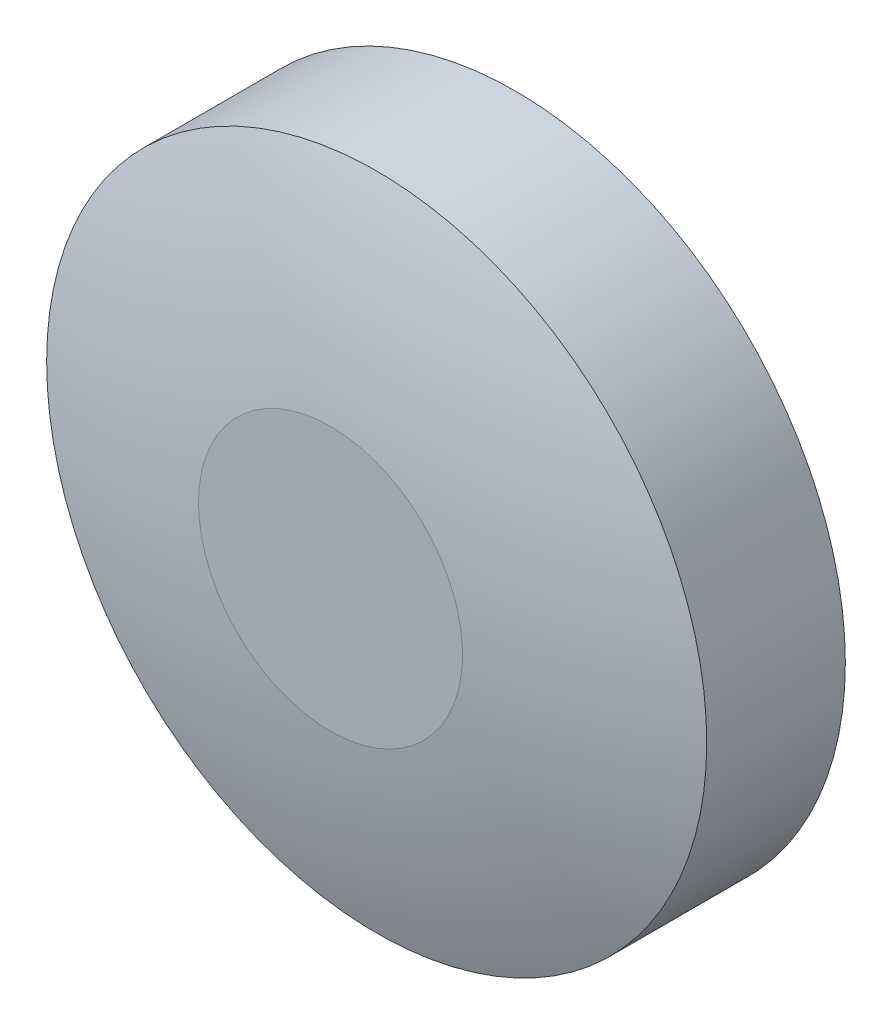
ISO-10303-21;
HEADER;
FILE_DESCRIPTION(('STEP AP214'),'2;1');
FILE_NAME('part.step','',(''),(''),'','','');
FILE_SCHEMA(('AUTOMOTIVE_DESIGN { 1 0 10303 214 1 1 1 1 }'));
ENDSEC;
DATA;
#1=APPLICATION_CONTEXT('core data for automotive mechanical design processes');
#2=APPLICATION_PROTOCOL_DEFINITION('international standard','automotive_design',2000,#1);
#3=PRODUCT_CONTEXT('',#1,'mechanical');
#4=PRODUCT('Part','Part','',(#3));
#5=PRODUCT_RELATED_PRODUCT_CATEGORY('part','',(#4));
#6=PRODUCT_DEFINITION_FORMATION('','',#4);
#7=PRODUCT_DEFINITION_CONTEXT('part definition',#1,'design');
#8=PRODUCT_DEFINITION('design','',#6,#7);
#9=PRODUCT_DEFINITION_SHAPE('','',#8);
#10=(LENGTH_UNIT() NAMED_UNIT(*) SI_UNIT(.MILLI.,.METRE.));
#11=(NAMED_UNIT(*) PLANE_ANGLE_UNIT() SI_UNIT($,.RADIAN.));
#12=(NAMED_UNIT(*) SI_UNIT($,.STERADIAN.) SOLID_ANGLE_UNIT());
#13=UNCERTAINTY_MEASURE_WITH_UNIT(LENGTH_MEASURE(1.E-05),#10,'distance_accuracy_value','');
#14=(GEOMETRIC_REPRESENTATION_CONTEXT(3) GLOBAL_UNCERTAINTY_ASSIGNED_CONTEXT((#13)) GLOBAL_UNIT_ASSIGNED_CONTEXT((#10,
#11,#12)) REPRESENTATION_CONTEXT('',''));
#15=CARTESIAN_POINT('',(0.,0.,0.));
#16=DIRECTION('',(0.,0.,1.));
#17=DIRECTION('',(1.,0.,0.));
#18=AXIS2_PLACEMENT_3D('',#15,#16,#17);
#19=CARTESIAN_POINT('',(0.,2.44243974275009,6.));
#20=DIRECTION('',(0.,0.,-1.));
#21=DIRECTION('',(-1.,0.,0.));
#22=AXIS2_PLACEMENT_3D('',#19,#20,#21);
#23=PLANE('',#22);
#24=CARTESIAN_POINT('',(0.,0.,6.));
#25=DIRECTION('',(0.,0.,-1.));
#26=DIRECTION('',(-1.,0.,0.));
#27=AXIS2_PLACEMENT_3D('',#24,#25,#26);
#28=CIRCLE('',#27,4.88487948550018);
#29=CARTESIAN_POINT('',(-4.88487948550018,0.,6.));
#30=VERTEX_POINT('',#29);
#31=EDGE_CURVE('E15',#30,#30,#28,.T.);
#32=ORIENTED_EDGE('',*,*,#31,.T.);
#33=EDGE_LOOP('',(#32));
#34=FACE_BOUND('',#33,.T.);
#35=ADVANCED_FACE('F12',(#34),#23,.T.);
#36=CARTESIAN_POINT('',(0.,0.,4.45647187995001));
#37=DIRECTION('',(0.,0.,-1.));
#38=DIRECTION('',(-1.,0.,0.));
#39=AXIS2_PLACEMENT_3D('',#36,#37,#38);
#40=CONICAL_SURFACE('',#39,11.5,1.3415643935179);
#41=ORIENTED_EDGE('',*,*,#31,.F.);
#42=EDGE_LOOP('',(#41));
#43=FACE_BOUND('',#42,.T.);
#44=CARTESIAN_POINT('',(0.,0.,4.45647187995));
#45=DIRECTION('',(0.,0.,1.));
#46=DIRECTION('',(1.,0.,0.));
#47=AXIS2_PLACEMENT_3D('',#44,#45,#46);
#48=CIRCLE('',#47,11.5);
#49=CARTESIAN_POINT('',(11.5,0.,4.45647187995));
#50=VERTEX_POINT('',#49);
#51=EDGE_CURVE('E28',#50,#50,#48,.F.);
#52=ORIENTED_EDGE('',*,*,#51,.T.);
#53=EDGE_LOOP('',(#52));
#54=FACE_BOUND('',#53,.T.);
#55=ADVANCED_FACE('F41',(#43,#54),#40,.F.);
#56=CARTESIAN_POINT('',(0.,0.,2.228235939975));
#57=DIRECTION('',(0.,0.,1.));
#58=DIRECTION('',(1.,0.,0.));
#59=AXIS2_PLACEMENT_3D('',#56,#57,#58);
#60=CYLINDRICAL_SURFACE('',#59,11.5);
#61=ORIENTED_EDGE('',*,*,#51,.F.);
#62=EDGE_LOOP('',(#61));
#63=FACE_BOUND('',#62,.T.);
#64=CARTESIAN_POINT('',(0.,0.,0.));
#65=DIRECTION('',(0.,0.,1.));
#66=DIRECTION('',(1.,0.,0.));
#67=AXIS2_PLACEMENT_3D('',#64,#65,#66);
#68=CIRCLE('',#67,11.5);
#69=CARTESIAN_POINT('',(11.5,0.,0.));
#70=VERTEX_POINT('',#69);
#71=EDGE_CURVE('E30',#70,#70,#68,.T.);
#72=ORIENTED_EDGE('',*,*,#71,.F.);
#73=EDGE_LOOP('',(#72));
#74=FACE_BOUND('',#73,.T.);
#75=ADVANCED_FACE('F43',(#63,#74),#60,.F.);
#76=CARTESIAN_POINT('',(0.,12.,0.));
#77=DIRECTION('',(0.,0.,-1.));
#78=DIRECTION('',(-1.,0.,0.));
#79=AXIS2_PLACEMENT_3D('',#76,#77,#78);
#80=PLANE('',#79);
#81=CARTESIAN_POINT('',(0.,0.,0.));
#82=DIRECTION('',(0.,0.,1.));
#83=DIRECTION('',(1.,0.,0.));
#84=AXIS2_PLACEMENT_3D('',#81,#82,#83);
#85=CIRCLE('',#84,12.5);
#86=CARTESIAN_POINT('',(12.5,0.,0.));
#87=VERTEX_POINT('',#86);
#88=EDGE_CURVE('E24',#87,#87,#85,.T.);
#89=ORIENTED_EDGE('',*,*,#88,.F.);
#90=EDGE_LOOP('',(#89));
#91=FACE_BOUND('',#90,.T.);
#92=ORIENTED_EDGE('',*,*,#71,.T.);
#93=EDGE_LOOP('',(#92));
#94=FACE_BOUND('',#93,.T.);
#95=ADVANCED_FACE('F50',(#91,#94),#80,.T.);
#96=CARTESIAN_POINT('',(0.,0.,2.625));
#97=DIRECTION('',(0.,0.,1.));
#98=DIRECTION('',(1.,0.,0.));
#99=AXIS2_PLACEMENT_3D('',#96,#97,#98);
#100=CYLINDRICAL_SURFACE('',#99,12.5);
#101=CARTESIAN_POINT('',(0.,0.,5.25));
#102=DIRECTION('',(0.,0.,-1.));
#103=DIRECTION('',(-1.,0.,0.));
#104=AXIS2_PLACEMENT_3D('',#101,#102,#103);
#105=CIRCLE('',#104,12.5);
#106=CARTESIAN_POINT('',(-12.5,0.,5.25));
#107=VERTEX_POINT('',#106);
#108=EDGE_CURVE('E19',#107,#107,#105,.F.);
#109=ORIENTED_EDGE('',*,*,#108,.F.);
#110=EDGE_LOOP('',(#109));
#111=FACE_BOUND('',#110,.T.);
#112=ORIENTED_EDGE('',*,*,#88,.T.);
#113=EDGE_LOOP('',(#112));
#114=FACE_BOUND('',#113,.T.);
#115=ADVANCED_FACE('F62',(#111,#114),#100,.T.);
#116=CARTESIAN_POINT('',(0.,2.5,7.));
#117=DIRECTION('',(0.,0.,1.));
#118=DIRECTION('',(0.,1.,0.));
#119=AXIS2_PLACEMENT_3D('',#116,#117,#118);
#120=PLANE('',#119);
#121=CARTESIAN_POINT('',(0.,0.,7.));
#122=DIRECTION('',(0.,0.,-1.));
#123=DIRECTION('',(-1.,0.,0.));
#124=AXIS2_PLACEMENT_3D('',#121,#122,#123);
#125=CIRCLE('',#124,4.99999999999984);
#126=CARTESIAN_POINT('',(-4.99999999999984,0.,7.));
#127=VERTEX_POINT('',#126);
#128=EDGE_CURVE('E8',#127,#127,#125,.T.);
#129=ORIENTED_EDGE('',*,*,#128,.F.);
#130=EDGE_LOOP('',(#129));
#131=FACE_BOUND('',#130,.T.);
#132=ADVANCED_FACE('F55',(#131),#120,.T.);
#133=CARTESIAN_POINT('',(-0.845244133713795,0.,-27.7525251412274));
#134=DIRECTION('',(0.,1.,0.));
#135=DIRECTION('',(-1.,0.,0.));
#136=AXIS2_PLACEMENT_3D('',#133,#134,#135);
#137=CIRCLE('',#136,35.0000000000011);
#138=TRIMMED_CURVE('',#137,(PARAMETER_VALUE(-1.59494850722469)),
(PARAMETER_VALUE(1.59494850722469)),.T.,.PARAMETER.);
#139=CARTESIAN_POINT('',(0.,0.,-27.7525251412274));
#140=DIRECTION('',(0.,0.,-1.));
#141=AXIS1_PLACEMENT('',#139,#140);
#142=SURFACE_OF_REVOLUTION('',#138,#141);
#143=ORIENTED_EDGE('',*,*,#108,.T.);
#144=EDGE_LOOP('',(#143));
#145=FACE_BOUND('',#144,.T.);
#146=ORIENTED_EDGE('',*,*,#128,.T.);
#147=EDGE_LOOP('',(#146));
#148=FACE_BOUND('',#147,.T.);
#149=ADVANCED_FACE('F53',(#145,#148),#142,.F.);
#150=CLOSED_SHELL('',(#35,#55,#75,#95,#115,#132,#149));
#151=MANIFOLD_SOLID_BREP('B1',#150);
#152=ADVANCED_BREP_SHAPE_REPRESENTATION('',(#18,#151),#14);
#153=SHAPE_DEFINITION_REPRESENTATION(#9,#152);
ENDSEC;
END-ISO-10303-21;
